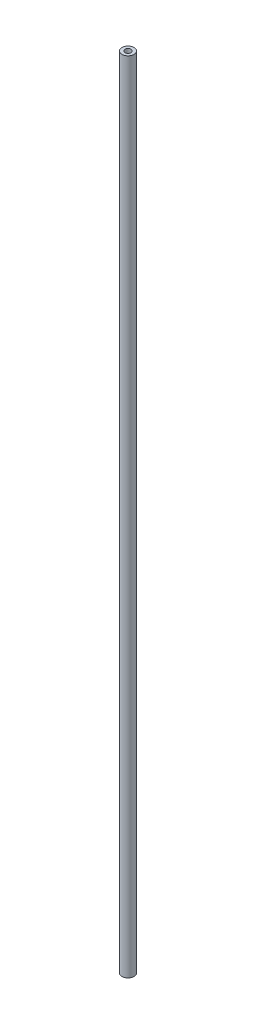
ISO-10303-21;
HEADER;
FILE_DESCRIPTION(('STEP AP214'),'2;1');
FILE_NAME('part.step','',(''),(''),'','','');
FILE_SCHEMA(('AUTOMOTIVE_DESIGN { 1 0 10303 214 1 1 1 1 }'));
ENDSEC;
DATA;
#1=APPLICATION_CONTEXT('core data for automotive mechanical design processes');
#2=APPLICATION_PROTOCOL_DEFINITION('international standard','automotive_design',2000,#1);
#3=PRODUCT_CONTEXT('',#1,'mechanical');
#4=PRODUCT('Part','Part','',(#3));
#5=PRODUCT_RELATED_PRODUCT_CATEGORY('part','',(#4));
#6=PRODUCT_DEFINITION_FORMATION('','',#4);
#7=PRODUCT_DEFINITION_CONTEXT('part definition',#1,'design');
#8=PRODUCT_DEFINITION('design','',#6,#7);
#9=PRODUCT_DEFINITION_SHAPE('','',#8);
#10=(LENGTH_UNIT() NAMED_UNIT(*) SI_UNIT(.MILLI.,.METRE.));
#11=(NAMED_UNIT(*) PLANE_ANGLE_UNIT() SI_UNIT($,.RADIAN.));
#12=(NAMED_UNIT(*) SI_UNIT($,.STERADIAN.) SOLID_ANGLE_UNIT());
#13=UNCERTAINTY_MEASURE_WITH_UNIT(LENGTH_MEASURE(1.E-05),#10,'distance_accuracy_value','');
#14=(GEOMETRIC_REPRESENTATION_CONTEXT(3) GLOBAL_UNCERTAINTY_ASSIGNED_CONTEXT((#13)) GLOBAL_UNIT_ASSIGNED_CONTEXT((#10,
#11,#12)) REPRESENTATION_CONTEXT('',''));
#15=CARTESIAN_POINT('',(0.,0.,0.));
#16=DIRECTION('',(0.,0.,1.));
#17=DIRECTION('',(1.,0.,0.));
#18=AXIS2_PLACEMENT_3D('',#15,#16,#17);
#19=CARTESIAN_POINT('',(0.,859.970512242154,0.));
#20=DIRECTION('',(0.,-1.,0.));
#21=DIRECTION('',(0.,0.,-1.));
#22=AXIS2_PLACEMENT_3D('',#19,#20,#21);
#23=CYLINDRICAL_SURFACE('',#22,6.35);
#24=CARTESIAN_POINT('',(0.,0.,0.));
#25=DIRECTION('',(0.,1.,0.));
#26=DIRECTION('',(0.,0.,1.));
#27=AXIS2_PLACEMENT_3D('',#24,#25,#26);
#28=CIRCLE('',#27,6.35);
#29=CARTESIAN_POINT('',(0.,0.,6.35));
#30=VERTEX_POINT('',#29);
#31=EDGE_CURVE('E40',#30,#30,#28,.T.);
#32=ORIENTED_EDGE('',*,*,#31,.T.);
#33=EDGE_LOOP('',(#32));
#34=FACE_BOUND('',#33,.T.);
#35=CARTESIAN_POINT('',(0.,842.010000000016,0.));
#36=DIRECTION('',(0.,1.,0.));
#37=DIRECTION('',(-1.,0.,0.));
#38=AXIS2_PLACEMENT_3D('',#35,#36,#37);
#39=CIRCLE('',#38,6.35);
#40=CARTESIAN_POINT('',(-6.35,842.010000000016,0.));
#41=VERTEX_POINT('',#40);
#42=EDGE_CURVE('E10',#41,#41,#39,.T.);
#43=ORIENTED_EDGE('',*,*,#42,.F.);
#44=EDGE_LOOP('',(#43));
#45=FACE_BOUND('',#44,.T.);
#46=ADVANCED_FACE('F33',(#34,#45),#23,.T.);
#47=CARTESIAN_POINT('',(0.,0.,0.));
#48=DIRECTION('',(0.,1.,0.));
#49=DIRECTION('',(0.,0.,1.));
#50=AXIS2_PLACEMENT_3D('',#47,#48,#49);
#51=PLANE('',#50);
#52=ORIENTED_EDGE('',*,*,#31,.F.);
#53=EDGE_LOOP('',(#52));
#54=FACE_BOUND('',#53,.T.);
#55=CARTESIAN_POINT('',(0.,0.,0.));
#56=DIRECTION('',(0.,1.,0.));
#57=DIRECTION('',(0.,0.,1.));
#58=AXIS2_PLACEMENT_3D('',#55,#56,#57);
#59=CIRCLE('',#58,3.175);
#60=CARTESIAN_POINT('',(0.,0.,3.175));
#61=VERTEX_POINT('',#60);
#62=EDGE_CURVE('E45',#61,#61,#59,.T.);
#63=ORIENTED_EDGE('',*,*,#62,.T.);
#64=EDGE_LOOP('',(#63));
#65=FACE_BOUND('',#64,.T.);
#66=ADVANCED_FACE('F61',(#54,#65),#51,.F.);
#67=CARTESIAN_POINT('',(0.,859.970512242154,0.));
#68=DIRECTION('',(0.,-1.,0.));
#69=DIRECTION('',(0.,0.,-1.));
#70=AXIS2_PLACEMENT_3D('',#67,#68,#69);
#71=CYLINDRICAL_SURFACE('',#70,3.175);
#72=ORIENTED_EDGE('',*,*,#62,.F.);
#73=EDGE_LOOP('',(#72));
#74=FACE_BOUND('',#73,.T.);
#75=CARTESIAN_POINT('',(0.,842.010000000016,0.));
#76=DIRECTION('',(0.,1.,0.));
#77=DIRECTION('',(-1.,0.,0.));
#78=AXIS2_PLACEMENT_3D('',#75,#76,#77);
#79=CIRCLE('',#78,3.175);
#80=CARTESIAN_POINT('',(-3.175,842.010000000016,0.));
#81=VERTEX_POINT('',#80);
#82=EDGE_CURVE('E36',#81,#81,#79,.T.);
#83=ORIENTED_EDGE('',*,*,#82,.T.);
#84=EDGE_LOOP('',(#83));
#85=FACE_BOUND('',#84,.T.);
#86=ADVANCED_FACE('F53',(#74,#85),#71,.F.);
#87=CARTESIAN_POINT('',(-88.012448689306,842.010000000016,-52.4759321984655));
#88=DIRECTION('',(0.,1.,0.));
#89=DIRECTION('',(-0.185797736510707,0.,0.982588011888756));
#90=AXIS2_PLACEMENT_3D('',#87,#88,#89);
#91=PLANE('',#90);
#92=ORIENTED_EDGE('',*,*,#82,.F.);
#93=EDGE_LOOP('',(#92));
#94=FACE_BOUND('',#93,.T.);
#95=ORIENTED_EDGE('',*,*,#42,.T.);
#96=EDGE_LOOP('',(#95));
#97=FACE_BOUND('',#96,.T.);
#98=ADVANCED_FACE('F55',(#94,#97),#91,.T.);
#99=CLOSED_SHELL('',(#46,#66,#86,#98));
#100=MANIFOLD_SOLID_BREP('B2',#99);
#101=ADVANCED_BREP_SHAPE_REPRESENTATION('',(#18,#100),#14);
#102=SHAPE_DEFINITION_REPRESENTATION(#9,#101);
ENDSEC;
END-ISO-10303-21;
